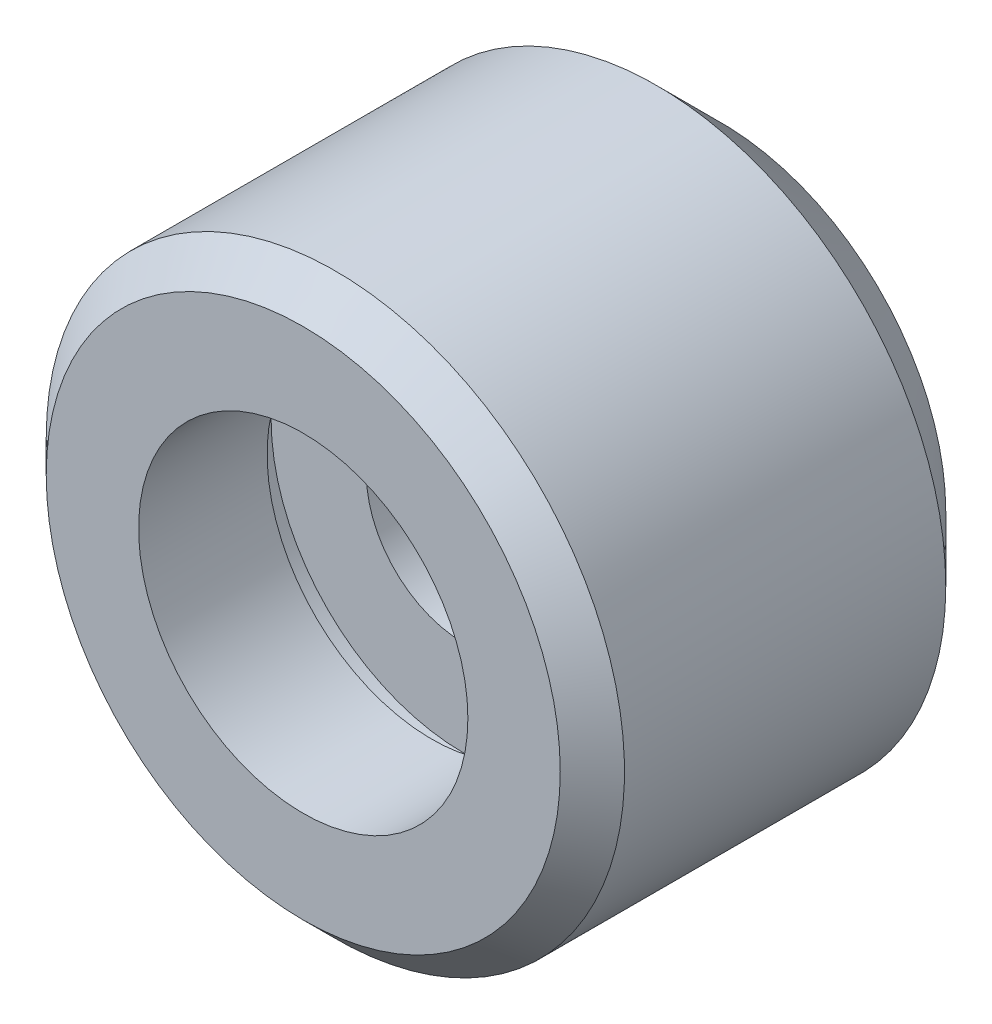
ISO-10303-21;
HEADER;
FILE_DESCRIPTION(('STEP AP214'),'2;1');
FILE_NAME('part.step','',(''),(''),'','','');
FILE_SCHEMA(('AUTOMOTIVE_DESIGN { 1 0 10303 214 1 1 1 1 }'));
ENDSEC;
DATA;
#1=APPLICATION_CONTEXT('core data for automotive mechanical design processes');
#2=APPLICATION_PROTOCOL_DEFINITION('international standard','automotive_design',2000,#1);
#3=PRODUCT_CONTEXT('',#1,'mechanical');
#4=PRODUCT('Part','Part','',(#3));
#5=PRODUCT_RELATED_PRODUCT_CATEGORY('part','',(#4));
#6=PRODUCT_DEFINITION_FORMATION('','',#4);
#7=PRODUCT_DEFINITION_CONTEXT('part definition',#1,'design');
#8=PRODUCT_DEFINITION('design','',#6,#7);
#9=PRODUCT_DEFINITION_SHAPE('','',#8);
#10=(LENGTH_UNIT() NAMED_UNIT(*) SI_UNIT(.MILLI.,.METRE.));
#11=(NAMED_UNIT(*) PLANE_ANGLE_UNIT() SI_UNIT($,.RADIAN.));
#12=(NAMED_UNIT(*) SI_UNIT($,.STERADIAN.) SOLID_ANGLE_UNIT());
#13=UNCERTAINTY_MEASURE_WITH_UNIT(LENGTH_MEASURE(1.E-05),#10,'distance_accuracy_value','');
#14=(GEOMETRIC_REPRESENTATION_CONTEXT(3) GLOBAL_UNCERTAINTY_ASSIGNED_CONTEXT((#13)) GLOBAL_UNIT_ASSIGNED_CONTEXT((#10,
#11,#12)) REPRESENTATION_CONTEXT('',''));
#15=CARTESIAN_POINT('',(0.,0.,0.));
#16=DIRECTION('',(0.,0.,1.));
#17=DIRECTION('',(1.,0.,0.));
#18=AXIS2_PLACEMENT_3D('',#15,#16,#17);
#19=CARTESIAN_POINT('',(0.,0.,13.));
#20=DIRECTION('',(0.,0.,-1.));
#21=DIRECTION('',(-1.,0.,0.));
#22=AXIS2_PLACEMENT_3D('',#19,#20,#21);
#23=CYLINDRICAL_SURFACE('',#22,9.);
#24=CARTESIAN_POINT('',(0.,0.,2.00000000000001));
#25=DIRECTION('',(0.,0.,1.));
#26=DIRECTION('',(1.,0.,0.));
#27=AXIS2_PLACEMENT_3D('',#24,#25,#26);
#28=CIRCLE('',#27,9.);
#29=CARTESIAN_POINT('',(-9.,0.,2.00000000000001));
#30=VERTEX_POINT('',#29);
#31=EDGE_CURVE('E52',#30,#30,#28,.T.);
#32=CARTESIAN_POINT('',(0.,0.,12.));
#33=DIRECTION('',(0.,0.,1.));
#34=DIRECTION('',(1.,0.,0.));
#35=AXIS2_PLACEMENT_3D('',#32,#33,#34);
#36=CIRCLE('',#35,9.);
#37=CARTESIAN_POINT('',(-9.,0.,12.));
#38=VERTEX_POINT('',#37);
#39=EDGE_CURVE('E57',#38,#38,#36,.F.);
#40=CARTESIAN_POINT('',(-9.,0.,2.00000000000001));
#41=CARTESIAN_POINT('',(-9.,0.,2.10416666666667));
#42=CARTESIAN_POINT('',(-9.,0.,2.20833333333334));
#43=CARTESIAN_POINT('',(-9.,0.,2.41666666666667));
#44=CARTESIAN_POINT('',(-9.,0.,2.52083333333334));
#45=CARTESIAN_POINT('',(-9.,0.,2.72916666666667));
#46=CARTESIAN_POINT('',(-9.,0.,2.83333333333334));
#47=CARTESIAN_POINT('',(-9.,0.,3.04166666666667));
#48=CARTESIAN_POINT('',(-9.,0.,3.14583333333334));
#49=CARTESIAN_POINT('',(-9.,0.,3.35416666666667));
#50=CARTESIAN_POINT('',(-9.,0.,3.45833333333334));
#51=CARTESIAN_POINT('',(-9.,0.,3.66666666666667));
#52=CARTESIAN_POINT('',(-9.,0.,3.77083333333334));
#53=CARTESIAN_POINT('',(-9.,0.,3.97916666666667));
#54=CARTESIAN_POINT('',(-9.,0.,4.08333333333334));
#55=CARTESIAN_POINT('',(-9.,0.,4.29166666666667));
#56=CARTESIAN_POINT('',(-9.,0.,4.39583333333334));
#57=CARTESIAN_POINT('',(-9.,0.,4.60416666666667));
#58=CARTESIAN_POINT('',(-9.,0.,4.70833333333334));
#59=CARTESIAN_POINT('',(-9.,0.,4.91666666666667));
#60=CARTESIAN_POINT('',(-9.,0.,5.02083333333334));
#61=CARTESIAN_POINT('',(-9.,0.,5.22916666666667));
#62=CARTESIAN_POINT('',(-9.,0.,5.33333333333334));
#63=CARTESIAN_POINT('',(-9.,0.,5.54166666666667));
#64=CARTESIAN_POINT('',(-9.,0.,5.64583333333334));
#65=CARTESIAN_POINT('',(-9.,0.,5.85416666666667));
#66=CARTESIAN_POINT('',(-9.,0.,5.95833333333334));
#67=CARTESIAN_POINT('',(-9.,0.,6.16666666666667));
#68=CARTESIAN_POINT('',(-9.,0.,6.27083333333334));
#69=CARTESIAN_POINT('',(-9.,0.,6.47916666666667));
#70=CARTESIAN_POINT('',(-9.,0.,6.58333333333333));
#71=CARTESIAN_POINT('',(-9.,0.,6.79166666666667));
#72=CARTESIAN_POINT('',(-9.,0.,6.89583333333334));
#73=CARTESIAN_POINT('',(-9.,0.,7.10416666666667));
#74=CARTESIAN_POINT('',(-9.,0.,7.20833333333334));
#75=CARTESIAN_POINT('',(-9.,0.,7.41666666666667));
#76=CARTESIAN_POINT('',(-9.,0.,7.52083333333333));
#77=CARTESIAN_POINT('',(-9.,0.,7.72916666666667));
#78=CARTESIAN_POINT('',(-9.,0.,7.83333333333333));
#79=CARTESIAN_POINT('',(-9.,0.,8.04166666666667));
#80=CARTESIAN_POINT('',(-9.,0.,8.14583333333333));
#81=CARTESIAN_POINT('',(-9.,0.,8.35416666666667));
#82=CARTESIAN_POINT('',(-9.,0.,8.45833333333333));
#83=CARTESIAN_POINT('',(-9.,0.,8.66666666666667));
#84=CARTESIAN_POINT('',(-9.,0.,8.77083333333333));
#85=CARTESIAN_POINT('',(-9.,0.,8.97916666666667));
#86=CARTESIAN_POINT('',(-9.,0.,9.08333333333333));
#87=CARTESIAN_POINT('',(-9.,0.,9.29166666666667));
#88=CARTESIAN_POINT('',(-9.,0.,9.39583333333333));
#89=CARTESIAN_POINT('',(-9.,0.,9.60416666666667));
#90=CARTESIAN_POINT('',(-9.,0.,9.70833333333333));
#91=CARTESIAN_POINT('',(-9.,0.,9.91666666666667));
#92=CARTESIAN_POINT('',(-9.,0.,10.0208333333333));
#93=CARTESIAN_POINT('',(-9.,0.,10.2291666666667));
#94=CARTESIAN_POINT('',(-9.,0.,10.3333333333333));
#95=CARTESIAN_POINT('',(-9.,0.,10.5416666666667));
#96=CARTESIAN_POINT('',(-9.,0.,10.6458333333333));
#97=CARTESIAN_POINT('',(-9.,0.,10.8541666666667));
#98=CARTESIAN_POINT('',(-9.,0.,10.9583333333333));
#99=CARTESIAN_POINT('',(-9.,0.,11.1666666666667));
#100=CARTESIAN_POINT('',(-9.,0.,11.2708333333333));
#101=CARTESIAN_POINT('',(-9.,0.,11.4791666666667));
#102=CARTESIAN_POINT('',(-9.,0.,11.5833333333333));
#103=CARTESIAN_POINT('',(-9.,0.,11.7916666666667));
#104=CARTESIAN_POINT('',(-9.,0.,11.8958333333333));
#105=CARTESIAN_POINT('',(-9.,0.,12.));
#106=B_SPLINE_CURVE_WITH_KNOTS('',3,(#40,#41,#42,#43,#44,#45,#46,#47,#48,#49,#50,#51,#52,#53,
#54,#55,#56,#57,#58,#59,#60,#61,#62,#63,#64,#65,#66,#67,#68,#69,#70,#71,#72,#73,#74,#75,#76,#77,
#78,#79,#80,#81,#82,#83,#84,#85,#86,#87,#88,#89,#90,#91,#92,#93,#94,#95,#96,#97,#98,#99,#100,
#101,#102,#103,#104,#105),.UNSPECIFIED.,.F.,.F.,(4,2,2,2,2,2,2,2,2,2,2,2,2,2,2,2,2,2,2,2,2,2,2,
2,2,2,2,2,2,2,2,2,4),(0.,0.3125,0.625000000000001,0.937499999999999,1.25,1.5625,1.875,2.1875,
2.5,2.8125,3.125,3.4375,3.75,4.0625,4.375,4.6875,5.,5.3125,5.625,5.93749999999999,6.25,6.5625,
6.875,7.18749999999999,7.49999999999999,7.81249999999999,8.12499999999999,8.43749999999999,
8.74999999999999,9.06249999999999,9.37499999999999,9.68749999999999,9.99999999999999),.UNSPECIFIED.);
#107=EDGE_CURVE('BSEAM43',#30,#38,#106,.T.);
#108=ORIENTED_EDGE('',*,*,#31,.T.);
#109=ORIENTED_EDGE('',*,*,#39,.T.);
#110=ORIENTED_EDGE('',*,*,#107,.T.);
#111=ORIENTED_EDGE('',*,*,#107,.F.);
#112=EDGE_LOOP('',(#108,#110,#109,#111));
#113=FACE_BOUND('',#112,.T.);
#114=ADVANCED_FACE('F43',(#113),#23,.T.);
#115=CARTESIAN_POINT('',(0.,0.,13.));
#116=DIRECTION('',(0.,0.,1.));
#117=DIRECTION('',(1.,0.,0.));
#118=AXIS2_PLACEMENT_3D('',#115,#116,#117);
#119=PLANE('',#118);
#120=CARTESIAN_POINT('',(0.,0.,13.));
#121=DIRECTION('',(0.,0.,1.));
#122=DIRECTION('',(1.,0.,0.));
#123=AXIS2_PLACEMENT_3D('',#120,#121,#122);
#124=CIRCLE('',#123,5.125);
#125=CARTESIAN_POINT('',(5.125,0.,13.));
#126=VERTEX_POINT('',#125);
#127=EDGE_CURVE('E67',#126,#126,#124,.T.);
#128=ORIENTED_EDGE('',*,*,#127,.F.);
#129=EDGE_LOOP('',(#128));
#130=FACE_BOUND('',#129,.T.);
#131=CARTESIAN_POINT('',(0.,0.,13.));
#132=DIRECTION('',(0.,0.,1.));
#133=DIRECTION('',(1.,0.,0.));
#134=AXIS2_PLACEMENT_3D('',#131,#132,#133);
#135=CIRCLE('',#134,8.00000000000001);
#136=CARTESIAN_POINT('',(8.00000000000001,0.,13.));
#137=VERTEX_POINT('',#136);
#138=EDGE_CURVE('E63',#137,#137,#135,.T.);
#139=ORIENTED_EDGE('',*,*,#138,.T.);
#140=EDGE_LOOP('',(#139));
#141=FACE_BOUND('',#140,.T.);
#142=ADVANCED_FACE('F118',(#130,#141),#119,.T.);
#143=CARTESIAN_POINT('',(0.,0.,0.));
#144=DIRECTION('',(0.,0.,1.));
#145=DIRECTION('',(1.,0.,0.));
#146=AXIS2_PLACEMENT_3D('',#143,#144,#145);
#147=PLANE('',#146);
#148=CARTESIAN_POINT('',(0.,0.,0.));
#149=DIRECTION('',(0.,0.,-1.));
#150=DIRECTION('',(-1.,0.,0.));
#151=AXIS2_PLACEMENT_3D('',#148,#149,#150);
#152=CIRCLE('',#151,3.035);
#153=CARTESIAN_POINT('',(-3.035,0.,0.));
#154=VERTEX_POINT('',#153);
#155=EDGE_CURVE('E83',#154,#154,#152,.T.);
#156=ORIENTED_EDGE('',*,*,#155,.F.);
#157=EDGE_LOOP('',(#156));
#158=FACE_BOUND('',#157,.T.);
#159=CARTESIAN_POINT('',(0.,0.,0.));
#160=DIRECTION('',(0.,0.,1.));
#161=DIRECTION('',(1.,0.,0.));
#162=AXIS2_PLACEMENT_3D('',#159,#160,#161);
#163=CIRCLE('',#162,6.99999999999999);
#164=CARTESIAN_POINT('',(6.99999999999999,0.,0.));
#165=VERTEX_POINT('',#164);
#166=EDGE_CURVE('E10',#165,#165,#163,.F.);
#167=ORIENTED_EDGE('',*,*,#166,.T.);
#168=EDGE_LOOP('',(#167));
#169=FACE_BOUND('',#168,.T.);
#170=ADVANCED_FACE('F121',(#158,#169),#147,.F.);
#171=CARTESIAN_POINT('',(0.,0.,13.));
#172=DIRECTION('',(0.,0.,-1.));
#173=DIRECTION('',(-1.,0.,0.));
#174=AXIS2_PLACEMENT_3D('',#171,#172,#173);
#175=CONICAL_SURFACE('',#174,8.00000000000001,0.785398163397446);
#176=ORIENTED_EDGE('',*,*,#39,.F.);
#177=EDGE_LOOP('',(#176));
#178=FACE_BOUND('',#177,.T.);
#179=ORIENTED_EDGE('',*,*,#138,.F.);
#180=EDGE_LOOP('',(#179));
#181=FACE_BOUND('',#180,.T.);
#182=ADVANCED_FACE('F125',(#178,#181),#175,.T.);
#183=CARTESIAN_POINT('',(0.,0.,2.00000000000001));
#184=DIRECTION('',(0.,0.,1.));
#185=DIRECTION('',(1.,0.,0.));
#186=AXIS2_PLACEMENT_3D('',#183,#184,#185);
#187=CONICAL_SURFACE('',#186,9.,0.78539816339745);
#188=ORIENTED_EDGE('',*,*,#166,.F.);
#189=EDGE_LOOP('',(#188));
#190=FACE_BOUND('',#189,.T.);
#191=ORIENTED_EDGE('',*,*,#31,.F.);
#192=EDGE_LOOP('',(#191));
#193=FACE_BOUND('',#192,.T.);
#194=ADVANCED_FACE('F45',(#190,#193),#187,.T.);
#195=CARTESIAN_POINT('',(0.,0.,9.));
#196=DIRECTION('',(0.,0.,1.));
#197=DIRECTION('',(1.,0.,0.));
#198=AXIS2_PLACEMENT_3D('',#195,#196,#197);
#199=CYLINDRICAL_SURFACE('',#198,5.125);
#200=CARTESIAN_POINT('',(0.,0.,9.));
#201=DIRECTION('',(0.,0.,1.));
#202=DIRECTION('',(1.,0.,0.));
#203=AXIS2_PLACEMENT_3D('',#200,#201,#202);
#204=CIRCLE('',#203,5.125);
#205=CARTESIAN_POINT('',(5.125,0.,9.));
#206=VERTEX_POINT('',#205);
#207=EDGE_CURVE('E71',#206,#206,#204,.F.);
#208=ORIENTED_EDGE('',*,*,#207,.T.);
#209=EDGE_LOOP('',(#208));
#210=FACE_BOUND('',#209,.T.);
#211=ORIENTED_EDGE('',*,*,#127,.T.);
#212=EDGE_LOOP('',(#211));
#213=FACE_BOUND('',#212,.T.);
#214=ADVANCED_FACE('F109',(#210,#213),#199,.F.);
#215=CARTESIAN_POINT('',(0.,0.,9.));
#216=DIRECTION('',(0.,0.,1.));
#217=DIRECTION('',(1.,0.,0.));
#218=AXIS2_PLACEMENT_3D('',#215,#216,#217);
#219=PLANE('',#218);
#220=CARTESIAN_POINT('',(0.,0.,9.));
#221=DIRECTION('',(0.,0.,1.));
#222=DIRECTION('',(1.,0.,0.));
#223=AXIS2_PLACEMENT_3D('',#220,#221,#222);
#224=CIRCLE('',#223,6.);
#225=CARTESIAN_POINT('',(6.,0.,9.));
#226=VERTEX_POINT('',#225);
#227=EDGE_CURVE('E76',#226,#226,#224,.T.);
#228=ORIENTED_EDGE('',*,*,#227,.F.);
#229=EDGE_LOOP('',(#228));
#230=FACE_BOUND('',#229,.T.);
#231=ORIENTED_EDGE('',*,*,#207,.F.);
#232=EDGE_LOOP('',(#231));
#233=FACE_BOUND('',#232,.T.);
#234=ADVANCED_FACE('F103',(#230,#233),#219,.F.);
#235=CARTESIAN_POINT('',(0.,0.,8.));
#236=DIRECTION('',(0.,0.,1.));
#237=DIRECTION('',(1.,0.,0.));
#238=AXIS2_PLACEMENT_3D('',#235,#236,#237);
#239=CYLINDRICAL_SURFACE('',#238,6.);
#240=CARTESIAN_POINT('',(0.,0.,8.));
#241=DIRECTION('',(0.,0.,1.));
#242=DIRECTION('',(1.,0.,0.));
#243=AXIS2_PLACEMENT_3D('',#240,#241,#242);
#244=CIRCLE('',#243,6.);
#245=CARTESIAN_POINT('',(6.,0.,8.));
#246=VERTEX_POINT('',#245);
#247=EDGE_CURVE('E75',#246,#246,#244,.T.);
#248=ORIENTED_EDGE('',*,*,#247,.F.);
#249=EDGE_LOOP('',(#248));
#250=FACE_BOUND('',#249,.T.);
#251=ORIENTED_EDGE('',*,*,#227,.T.);
#252=EDGE_LOOP('',(#251));
#253=FACE_BOUND('',#252,.T.);
#254=ADVANCED_FACE('F97',(#250,#253),#239,.F.);
#255=CARTESIAN_POINT('',(0.,0.,8.));
#256=DIRECTION('',(0.,0.,1.));
#257=DIRECTION('',(1.,0.,0.));
#258=AXIS2_PLACEMENT_3D('',#255,#256,#257);
#259=PLANE('',#258);
#260=CARTESIAN_POINT('',(0.,0.,8.));
#261=DIRECTION('',(0.,0.,1.));
#262=DIRECTION('',(1.,0.,0.));
#263=AXIS2_PLACEMENT_3D('',#260,#261,#262);
#264=CIRCLE('',#263,3.035);
#265=CARTESIAN_POINT('',(-3.035,0.,8.));
#266=VERTEX_POINT('',#265);
#267=EDGE_CURVE('E47',#266,#266,#264,.T.);
#268=ORIENTED_EDGE('',*,*,#267,.F.);
#269=EDGE_LOOP('',(#268));
#270=FACE_BOUND('',#269,.T.);
#271=ORIENTED_EDGE('',*,*,#247,.T.);
#272=EDGE_LOOP('',(#271));
#273=FACE_BOUND('',#272,.T.);
#274=ADVANCED_FACE('F94',(#270,#273),#259,.T.);
#275=CARTESIAN_POINT('',(0.,0.,13.));
#276=DIRECTION('',(0.,0.,-1.));
#277=DIRECTION('',(-1.,0.,0.));
#278=AXIS2_PLACEMENT_3D('',#275,#276,#277);
#279=CYLINDRICAL_SURFACE('',#278,3.035);
#280=CARTESIAN_POINT('',(-3.035,0.,8.));
#281=CARTESIAN_POINT('',(-3.035,0.,7.91666666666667));
#282=CARTESIAN_POINT('',(-3.035,0.,7.83333333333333));
#283=CARTESIAN_POINT('',(-3.035,0.,7.66666666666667));
#284=CARTESIAN_POINT('',(-3.035,0.,7.58333333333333));
#285=CARTESIAN_POINT('',(-3.035,0.,7.41666666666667));
#286=CARTESIAN_POINT('',(-3.035,0.,7.33333333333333));
#287=CARTESIAN_POINT('',(-3.035,0.,7.16666666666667));
#288=CARTESIAN_POINT('',(-3.035,0.,7.08333333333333));
#289=CARTESIAN_POINT('',(-3.035,0.,6.91666666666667));
#290=CARTESIAN_POINT('',(-3.035,0.,6.83333333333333));
#291=CARTESIAN_POINT('',(-3.035,0.,6.66666666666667));
#292=CARTESIAN_POINT('',(-3.035,0.,6.58333333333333));
#293=CARTESIAN_POINT('',(-3.035,0.,6.41666666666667));
#294=CARTESIAN_POINT('',(-3.035,0.,6.33333333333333));
#295=CARTESIAN_POINT('',(-3.035,0.,6.16666666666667));
#296=CARTESIAN_POINT('',(-3.035,0.,6.08333333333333));
#297=CARTESIAN_POINT('',(-3.035,0.,5.91666666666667));
#298=CARTESIAN_POINT('',(-3.035,0.,5.83333333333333));
#299=CARTESIAN_POINT('',(-3.035,0.,5.66666666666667));
#300=CARTESIAN_POINT('',(-3.035,0.,5.58333333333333));
#301=CARTESIAN_POINT('',(-3.035,0.,5.41666666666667));
#302=CARTESIAN_POINT('',(-3.035,0.,5.33333333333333));
#303=CARTESIAN_POINT('',(-3.035,0.,5.16666666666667));
#304=CARTESIAN_POINT('',(-3.035,0.,5.08333333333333));
#305=CARTESIAN_POINT('',(-3.035,0.,4.91666666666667));
#306=CARTESIAN_POINT('',(-3.035,0.,4.83333333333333));
#307=CARTESIAN_POINT('',(-3.035,0.,4.66666666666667));
#308=CARTESIAN_POINT('',(-3.035,0.,4.58333333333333));
#309=CARTESIAN_POINT('',(-3.035,0.,4.41666666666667));
#310=CARTESIAN_POINT('',(-3.035,0.,4.33333333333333));
#311=CARTESIAN_POINT('',(-3.035,0.,4.16666666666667));
#312=CARTESIAN_POINT('',(-3.035,0.,4.08333333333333));
#313=CARTESIAN_POINT('',(-3.035,0.,3.91666666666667));
#314=CARTESIAN_POINT('',(-3.035,0.,3.83333333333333));
#315=CARTESIAN_POINT('',(-3.035,0.,3.66666666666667));
#316=CARTESIAN_POINT('',(-3.035,0.,3.58333333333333));
#317=CARTESIAN_POINT('',(-3.035,0.,3.41666666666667));
#318=CARTESIAN_POINT('',(-3.035,0.,3.33333333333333));
#319=CARTESIAN_POINT('',(-3.035,0.,3.16666666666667));
#320=CARTESIAN_POINT('',(-3.035,0.,3.08333333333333));
#321=CARTESIAN_POINT('',(-3.035,0.,2.91666666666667));
#322=CARTESIAN_POINT('',(-3.035,0.,2.83333333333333));
#323=CARTESIAN_POINT('',(-3.035,0.,2.66666666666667));
#324=CARTESIAN_POINT('',(-3.035,0.,2.58333333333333));
#325=CARTESIAN_POINT('',(-3.035,0.,2.41666666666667));
#326=CARTESIAN_POINT('',(-3.035,0.,2.33333333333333));
#327=CARTESIAN_POINT('',(-3.035,0.,2.16666666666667));
#328=CARTESIAN_POINT('',(-3.035,0.,2.08333333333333));
#329=CARTESIAN_POINT('',(-3.035,0.,1.91666666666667));
#330=CARTESIAN_POINT('',(-3.035,0.,1.83333333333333));
#331=CARTESIAN_POINT('',(-3.035,0.,1.66666666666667));
#332=CARTESIAN_POINT('',(-3.035,0.,1.58333333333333));
#333=CARTESIAN_POINT('',(-3.035,0.,1.41666666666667));
#334=CARTESIAN_POINT('',(-3.035,0.,1.33333333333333));
#335=CARTESIAN_POINT('',(-3.035,0.,1.16666666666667));
#336=CARTESIAN_POINT('',(-3.035,0.,1.08333333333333));
#337=CARTESIAN_POINT('',(-3.035,0.,0.916666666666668));
#338=CARTESIAN_POINT('',(-3.035,0.,0.833333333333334));
#339=CARTESIAN_POINT('',(-3.035,0.,0.666666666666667));
#340=CARTESIAN_POINT('',(-3.035,0.,0.583333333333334));
#341=CARTESIAN_POINT('',(-3.035,0.,0.416666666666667));
#342=CARTESIAN_POINT('',(-3.035,0.,0.333333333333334));
#343=CARTESIAN_POINT('',(-3.035,0.,0.166666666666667));
#344=CARTESIAN_POINT('',(-3.035,0.,0.0833333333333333));
#345=CARTESIAN_POINT('',(-3.035,0.,0.));
#346=B_SPLINE_CURVE_WITH_KNOTS('',3,(#280,#281,#282,#283,#284,#285,#286,#287,#288,#289,#290,
#291,#292,#293,#294,#295,#296,#297,#298,#299,#300,#301,#302,#303,#304,#305,#306,#307,#308,#309,
#310,#311,#312,#313,#314,#315,#316,#317,#318,#319,#320,#321,#322,#323,#324,#325,#326,#327,#328,
#329,#330,#331,#332,#333,#334,#335,#336,#337,#338,#339,#340,#341,#342,#343,#344,#345),
.UNSPECIFIED.,.F.,.F.,(4,2,2,2,2,2,2,2,2,2,2,2,2,2,2,2,2,2,2,2,2,2,2,2,2,2,2,2,2,2,2,2,4),(0.,
0.250000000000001,0.500000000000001,0.750000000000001,1.,1.25,1.5,1.75,2.,2.25,2.5,2.75,3.,3.25,
3.5,3.75,4.,4.25,4.5,4.75,5.,5.25,5.5,5.75,6.,6.25,6.5,6.75,7.,7.25,7.5,7.75,8.),.UNSPECIFIED.);
#347=EDGE_CURVE('BSEAM92',#266,#154,#346,.T.);
#348=ORIENTED_EDGE('',*,*,#267,.T.);
#349=ORIENTED_EDGE('',*,*,#155,.T.);
#350=ORIENTED_EDGE('',*,*,#347,.T.);
#351=ORIENTED_EDGE('',*,*,#347,.F.);
#352=EDGE_LOOP('',(#348,#350,#349,#351));
#353=FACE_BOUND('',#352,.T.);
#354=ADVANCED_FACE('F92',(#353),#279,.F.);
#355=CLOSED_SHELL('',(#114,#142,#170,#182,#194,#214,#234,#254,#274,#354));
#356=MANIFOLD_SOLID_BREP('B2',#355);
#357=ADVANCED_BREP_SHAPE_REPRESENTATION('',(#18,#356),#14);
#358=SHAPE_DEFINITION_REPRESENTATION(#9,#357);
ENDSEC;
END-ISO-10303-21;
